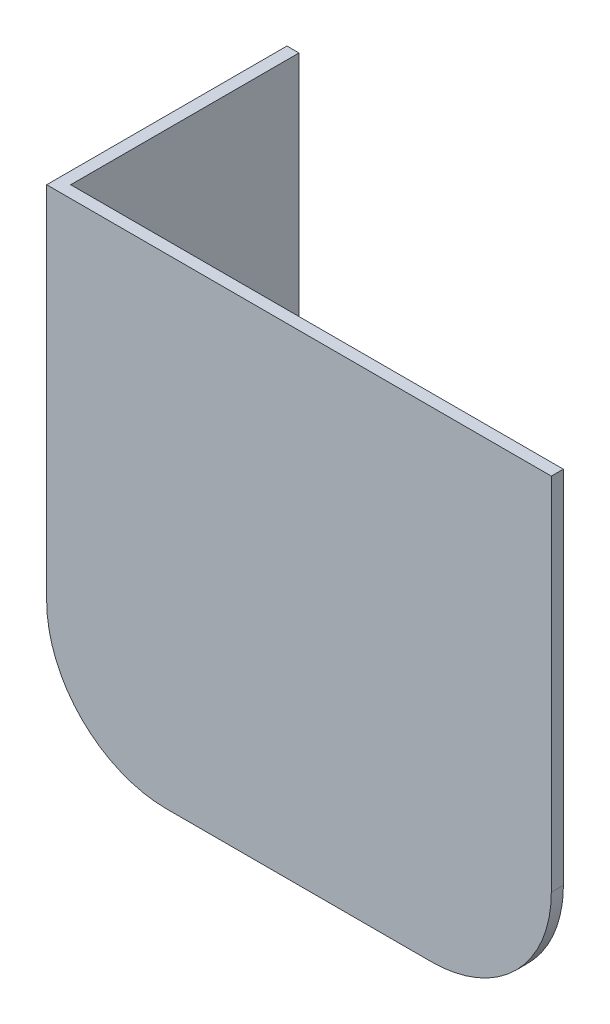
ISO-10303-21;
HEADER;
FILE_DESCRIPTION(('STEP AP214'),'2;1');
FILE_NAME('part.step','',(''),(''),'','','');
FILE_SCHEMA(('AUTOMOTIVE_DESIGN { 1 0 10303 214 1 1 1 1 }'));
ENDSEC;
DATA;
#1=APPLICATION_CONTEXT('core data for automotive mechanical design processes');
#2=APPLICATION_PROTOCOL_DEFINITION('international standard','automotive_design',2000,#1);
#3=PRODUCT_CONTEXT('',#1,'mechanical');
#4=PRODUCT('Part','Part','',(#3));
#5=PRODUCT_RELATED_PRODUCT_CATEGORY('part','',(#4));
#6=PRODUCT_DEFINITION_FORMATION('','',#4);
#7=PRODUCT_DEFINITION_CONTEXT('part definition',#1,'design');
#8=PRODUCT_DEFINITION('design','',#6,#7);
#9=PRODUCT_DEFINITION_SHAPE('','',#8);
#10=(LENGTH_UNIT() NAMED_UNIT(*) SI_UNIT(.MILLI.,.METRE.));
#11=(NAMED_UNIT(*) PLANE_ANGLE_UNIT() SI_UNIT($,.RADIAN.));
#12=(NAMED_UNIT(*) SI_UNIT($,.STERADIAN.) SOLID_ANGLE_UNIT());
#13=UNCERTAINTY_MEASURE_WITH_UNIT(LENGTH_MEASURE(1.E-05),#10,'distance_accuracy_value','');
#14=(GEOMETRIC_REPRESENTATION_CONTEXT(3) GLOBAL_UNCERTAINTY_ASSIGNED_CONTEXT((#13)) GLOBAL_UNIT_ASSIGNED_CONTEXT((#10,
#11,#12)) REPRESENTATION_CONTEXT('',''));
#15=CARTESIAN_POINT('',(0.,0.,0.));
#16=DIRECTION('',(0.,0.,1.));
#17=DIRECTION('',(1.,0.,0.));
#18=AXIS2_PLACEMENT_3D('',#15,#16,#17);
#19=CARTESIAN_POINT('',(0.,-508.,0.));
#20=DIRECTION('',(0.,0.,1.));
#21=DIRECTION('',(1.,0.,0.));
#22=AXIS2_PLACEMENT_3D('',#19,#20,#21);
#23=PLANE('',#22);
#24=DIRECTION('',(1.,0.,0.));
#25=VECTOR('',#24,1.);
#26=CARTESIAN_POINT('',(0.,-508.,0.));
#27=LINE('',#26,#25);
#28=CARTESIAN_POINT('',(127.,-508.,0.));
#29=VERTEX_POINT('',#28);
#30=CARTESIAN_POINT('',(406.4,-508.,0.));
#31=VERTEX_POINT('',#30);
#32=EDGE_CURVE('E144',#29,#31,#27,.T.);
#33=ORIENTED_EDGE('',*,*,#32,.T.);
#34=CARTESIAN_POINT('',(406.4,-381.,0.));
#35=DIRECTION('',(0.,0.,1.));
#36=DIRECTION('',(1.,0.,0.));
#37=AXIS2_PLACEMENT_3D('',#34,#35,#36);
#38=CIRCLE('',#37,127.);
#39=CARTESIAN_POINT('',(533.4,-381.,0.));
#40=VERTEX_POINT('',#39);
#41=EDGE_CURVE('E11',#31,#40,#38,.T.);
#42=ORIENTED_EDGE('',*,*,#41,.T.);
#43=DIRECTION('',(0.,1.,0.));
#44=VECTOR('',#43,1.);
#45=CARTESIAN_POINT('',(533.4,-508.,0.));
#46=LINE('',#45,#44);
#47=CARTESIAN_POINT('',(533.4,0.,0.));
#48=VERTEX_POINT('',#47);
#49=EDGE_CURVE('E142',#40,#48,#46,.T.);
#50=ORIENTED_EDGE('',*,*,#49,.T.);
#51=DIRECTION('',(1.,0.,0.));
#52=VECTOR('',#51,1.);
#53=CARTESIAN_POINT('',(0.,0.,0.));
#54=LINE('',#53,#52);
#55=CARTESIAN_POINT('',(0.,0.,0.));
#56=VERTEX_POINT('',#55);
#57=EDGE_CURVE('E127',#56,#48,#54,.T.);
#58=ORIENTED_EDGE('',*,*,#57,.F.);
#59=DIRECTION('',(0.,1.,0.));
#60=VECTOR('',#59,1.);
#61=CARTESIAN_POINT('',(0.,-508.,0.));
#62=LINE('',#61,#60);
#63=CARTESIAN_POINT('',(0.,-381.,0.));
#64=VERTEX_POINT('',#63);
#65=EDGE_CURVE('E135',#64,#56,#62,.T.);
#66=ORIENTED_EDGE('',*,*,#65,.F.);
#67=CARTESIAN_POINT('',(127.,-381.,0.));
#68=DIRECTION('',(0.,0.,1.));
#69=DIRECTION('',(1.,0.,0.));
#70=AXIS2_PLACEMENT_3D('',#67,#68,#69);
#71=CIRCLE('',#70,127.);
#72=EDGE_CURVE('E150',#64,#29,#71,.T.);
#73=ORIENTED_EDGE('',*,*,#72,.T.);
#74=EDGE_LOOP('',(#33,#42,#50,#58,#66,#73));
#75=FACE_BOUND('',#74,.T.);
#76=ADVANCED_FACE('F30',(#75),#23,.T.);
#77=CARTESIAN_POINT('',(0.,-508.,0.));
#78=DIRECTION('',(-1.,0.,0.));
#79=DIRECTION('',(0.,0.,1.));
#80=AXIS2_PLACEMENT_3D('',#77,#78,#79);
#81=PLANE('',#80);
#82=DIRECTION('',(0.,1.,0.));
#83=VECTOR('',#82,1.);
#84=CARTESIAN_POINT('',(0.,-508.,-254.));
#85=LINE('',#84,#83);
#86=CARTESIAN_POINT('',(0.,-381.,-254.));
#87=VERTEX_POINT('',#86);
#88=CARTESIAN_POINT('',(0.,0.,-254.));
#89=VERTEX_POINT('',#88);
#90=EDGE_CURVE('E133',#87,#89,#85,.T.);
#91=ORIENTED_EDGE('',*,*,#90,.F.);
#92=DIRECTION('',(0.,0.,1.));
#93=VECTOR('',#92,1.);
#94=CARTESIAN_POINT('',(0.,-381.,0.));
#95=LINE('',#94,#93);
#96=EDGE_CURVE('E147',#87,#64,#95,.T.);
#97=ORIENTED_EDGE('',*,*,#96,.T.);
#98=ORIENTED_EDGE('',*,*,#65,.T.);
#99=DIRECTION('',(0.,0.,1.));
#100=VECTOR('',#99,1.);
#101=CARTESIAN_POINT('',(0.,0.,0.));
#102=LINE('',#101,#100);
#103=EDGE_CURVE('E193',#89,#56,#102,.T.);
#104=ORIENTED_EDGE('',*,*,#103,.F.);
#105=EDGE_LOOP('',(#91,#97,#98,#104));
#106=FACE_BOUND('',#105,.T.);
#107=ADVANCED_FACE('F204',(#106),#81,.T.);
#108=CARTESIAN_POINT('',(0.,-508.,-254.));
#109=DIRECTION('',(0.,0.,-1.));
#110=DIRECTION('',(-1.,0.,0.));
#111=AXIS2_PLACEMENT_3D('',#108,#109,#110);
#112=PLANE('',#111);
#113=DIRECTION('',(-1.,0.,0.));
#114=VECTOR('',#113,1.);
#115=CARTESIAN_POINT('',(533.4,-398.78,-254.));
#116=LINE('',#115,#114);
#117=CARTESIAN_POINT('',(12.7,-398.78,-254.));
#118=VERTEX_POINT('',#117);
#119=CARTESIAN_POINT('',(1.25075904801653,-398.78,-254.));
#120=VERTEX_POINT('',#119);
#121=EDGE_CURVE('E106',#118,#120,#116,.T.);
#122=ORIENTED_EDGE('',*,*,#121,.T.);
#123=CARTESIAN_POINT('',(127.,-381.,-254.));
#124=DIRECTION('',(0.,0.,-1.));
#125=DIRECTION('',(-1.,0.,0.));
#126=AXIS2_PLACEMENT_3D('',#123,#124,#125);
#127=CIRCLE('',#126,127.);
#128=EDGE_CURVE('E159',#120,#87,#127,.T.);
#129=ORIENTED_EDGE('',*,*,#128,.T.);
#130=ORIENTED_EDGE('',*,*,#90,.T.);
#131=DIRECTION('',(-1.,0.,0.));
#132=VECTOR('',#131,1.);
#133=CARTESIAN_POINT('',(0.,0.,-254.));
#134=LINE('',#133,#132);
#135=CARTESIAN_POINT('',(12.7,0.,-254.));
#136=VERTEX_POINT('',#135);
#137=EDGE_CURVE('E131',#136,#89,#134,.T.);
#138=ORIENTED_EDGE('',*,*,#137,.F.);
#139=DIRECTION('',(0.,1.,0.));
#140=VECTOR('',#139,1.);
#141=CARTESIAN_POINT('',(12.7,-508.,-254.));
#142=LINE('',#141,#140);
#143=EDGE_CURVE('E124',#118,#136,#142,.T.);
#144=ORIENTED_EDGE('',*,*,#143,.F.);
#145=EDGE_LOOP('',(#122,#129,#130,#138,#144));
#146=FACE_BOUND('',#145,.T.);
#147=ADVANCED_FACE('F129',(#146),#112,.T.);
#148=CARTESIAN_POINT('',(12.7,-508.,-254.));
#149=DIRECTION('',(1.,0.,0.));
#150=DIRECTION('',(0.,0.,-1.));
#151=AXIS2_PLACEMENT_3D('',#148,#149,#150);
#152=PLANE('',#151);
#153=DIRECTION('',(0.,0.,1.));
#154=VECTOR('',#153,1.);
#155=CARTESIAN_POINT('',(12.7,-398.78,-254.));
#156=LINE('',#155,#154);
#157=CARTESIAN_POINT('',(12.7,-398.78,-12.7));
#158=VERTEX_POINT('',#157);
#159=EDGE_CURVE('E110',#118,#158,#156,.T.);
#160=ORIENTED_EDGE('',*,*,#159,.F.);
#161=ORIENTED_EDGE('',*,*,#143,.T.);
#162=DIRECTION('',(0.,0.,-1.));
#163=VECTOR('',#162,1.);
#164=CARTESIAN_POINT('',(12.7,0.,-254.));
#165=LINE('',#164,#163);
#166=CARTESIAN_POINT('',(12.7,0.,-12.7));
#167=VERTEX_POINT('',#166);
#168=EDGE_CURVE('E199',#167,#136,#165,.T.);
#169=ORIENTED_EDGE('',*,*,#168,.F.);
#170=DIRECTION('',(0.,1.,0.));
#171=VECTOR('',#170,1.);
#172=CARTESIAN_POINT('',(12.7,-508.,-12.7));
#173=LINE('',#172,#171);
#174=EDGE_CURVE('E126',#158,#167,#173,.T.);
#175=ORIENTED_EDGE('',*,*,#174,.F.);
#176=EDGE_LOOP('',(#160,#161,#169,#175));
#177=FACE_BOUND('',#176,.T.);
#178=ADVANCED_FACE('F122',(#177),#152,.T.);
#179=CARTESIAN_POINT('',(12.7,-508.,-12.7));
#180=DIRECTION('',(0.,0.,-1.));
#181=DIRECTION('',(-1.,0.,0.));
#182=AXIS2_PLACEMENT_3D('',#179,#180,#181);
#183=PLANE('',#182);
#184=DIRECTION('',(0.,1.,0.));
#185=VECTOR('',#184,1.);
#186=CARTESIAN_POINT('',(533.4,-508.,-12.7));
#187=LINE('',#186,#185);
#188=CARTESIAN_POINT('',(533.4,-381.,-12.7));
#189=VERTEX_POINT('',#188);
#190=CARTESIAN_POINT('',(533.4,0.,-12.7));
#191=VERTEX_POINT('',#190);
#192=EDGE_CURVE('E137',#189,#191,#187,.T.);
#193=ORIENTED_EDGE('',*,*,#192,.F.);
#194=CARTESIAN_POINT('',(406.4,-381.,-12.7));
#195=DIRECTION('',(0.,0.,-1.));
#196=DIRECTION('',(-1.,0.,0.));
#197=AXIS2_PLACEMENT_3D('',#194,#195,#196);
#198=CIRCLE('',#197,127.);
#199=CARTESIAN_POINT('',(532.149240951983,-398.78,-12.7));
#200=VERTEX_POINT('',#199);
#201=EDGE_CURVE('E164',#189,#200,#198,.T.);
#202=ORIENTED_EDGE('',*,*,#201,.T.);
#203=DIRECTION('',(1.,0.,0.));
#204=VECTOR('',#203,1.);
#205=CARTESIAN_POINT('',(12.7,-398.78,-12.7));
#206=LINE('',#205,#204);
#207=EDGE_CURVE('E117',#158,#200,#206,.T.);
#208=ORIENTED_EDGE('',*,*,#207,.F.);
#209=ORIENTED_EDGE('',*,*,#174,.T.);
#210=DIRECTION('',(-1.,0.,0.));
#211=VECTOR('',#210,1.);
#212=CARTESIAN_POINT('',(12.7,0.,-12.7));
#213=LINE('',#212,#211);
#214=EDGE_CURVE('E188',#191,#167,#213,.T.);
#215=ORIENTED_EDGE('',*,*,#214,.F.);
#216=EDGE_LOOP('',(#193,#202,#208,#209,#215));
#217=FACE_BOUND('',#216,.T.);
#218=ADVANCED_FACE('F211',(#217),#183,.T.);
#219=CARTESIAN_POINT('',(533.4,-508.,-12.7));
#220=DIRECTION('',(1.,0.,0.));
#221=DIRECTION('',(0.,0.,-1.));
#222=AXIS2_PLACEMENT_3D('',#219,#220,#221);
#223=PLANE('',#222);
#224=ORIENTED_EDGE('',*,*,#49,.F.);
#225=DIRECTION('',(0.,0.,-1.));
#226=VECTOR('',#225,1.);
#227=CARTESIAN_POINT('',(533.4,-381.,-12.7));
#228=LINE('',#227,#226);
#229=EDGE_CURVE('E161',#40,#189,#228,.T.);
#230=ORIENTED_EDGE('',*,*,#229,.T.);
#231=ORIENTED_EDGE('',*,*,#192,.T.);
#232=DIRECTION('',(0.,0.,-1.));
#233=VECTOR('',#232,1.);
#234=CARTESIAN_POINT('',(533.4,0.,-12.7));
#235=LINE('',#234,#233);
#236=EDGE_CURVE('E183',#48,#191,#235,.T.);
#237=ORIENTED_EDGE('',*,*,#236,.F.);
#238=EDGE_LOOP('',(#224,#230,#231,#237));
#239=FACE_BOUND('',#238,.T.);
#240=ADVANCED_FACE('F180',(#239),#223,.T.);
#241=CARTESIAN_POINT('',(533.4,-508.,0.));
#242=DIRECTION('',(0.,-1.,0.));
#243=DIRECTION('',(0.,0.,-1.));
#244=AXIS2_PLACEMENT_3D('',#241,#242,#243);
#245=PLANE('',#244);
#246=DIRECTION('',(-1.,0.,0.));
#247=VECTOR('',#246,1.);
#248=CARTESIAN_POINT('',(533.4,-508.,-12.6959141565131));
#249=LINE('',#248,#247);
#250=CARTESIAN_POINT('',(406.4,-508.,-12.6959141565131));
#251=VERTEX_POINT('',#250);
#252=CARTESIAN_POINT('',(127.,-508.,-12.6959141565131));
#253=VERTEX_POINT('',#252);
#254=EDGE_CURVE('E145',#251,#253,#249,.T.);
#255=ORIENTED_EDGE('',*,*,#254,.F.);
#256=DIRECTION('',(0.,0.,-1.));
#257=VECTOR('',#256,1.);
#258=CARTESIAN_POINT('',(406.4,-508.,0.));
#259=LINE('',#258,#257);
#260=EDGE_CURVE('E38',#251,#31,#259,.F.);
#261=ORIENTED_EDGE('',*,*,#260,.T.);
#262=ORIENTED_EDGE('',*,*,#32,.F.);
#263=DIRECTION('',(0.,0.,1.));
#264=VECTOR('',#263,1.);
#265=CARTESIAN_POINT('',(127.,-508.,0.));
#266=LINE('',#265,#264);
#267=EDGE_CURVE('E152',#29,#253,#266,.F.);
#268=ORIENTED_EDGE('',*,*,#267,.T.);
#269=EDGE_LOOP('',(#255,#261,#262,#268));
#270=FACE_BOUND('',#269,.T.);
#271=ADVANCED_FACE('F208',(#270),#245,.T.);
#272=CARTESIAN_POINT('',(533.4,0.,0.));
#273=DIRECTION('',(0.,-1.,0.));
#274=DIRECTION('',(0.,0.,-1.));
#275=AXIS2_PLACEMENT_3D('',#272,#273,#274);
#276=PLANE('',#275);
#277=ORIENTED_EDGE('',*,*,#57,.T.);
#278=ORIENTED_EDGE('',*,*,#236,.T.);
#279=ORIENTED_EDGE('',*,*,#214,.T.);
#280=ORIENTED_EDGE('',*,*,#168,.T.);
#281=ORIENTED_EDGE('',*,*,#137,.T.);
#282=ORIENTED_EDGE('',*,*,#103,.T.);
#283=EDGE_LOOP('',(#277,#278,#279,#280,#281,#282));
#284=FACE_BOUND('',#283,.T.);
#285=ADVANCED_FACE('F191',(#284),#276,.F.);
#286=CARTESIAN_POINT('',(533.4,-525.78,-12.6959141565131));
#287=DIRECTION('',(0.,0.,1.));
#288=DIRECTION('',(1.,0.,0.));
#289=AXIS2_PLACEMENT_3D('',#286,#287,#288);
#290=PLANE('',#289);
#291=DIRECTION('',(-1.,0.,0.));
#292=VECTOR('',#291,1.);
#293=CARTESIAN_POINT('',(533.4,-398.78,-12.6959141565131));
#294=LINE('',#293,#292);
#295=CARTESIAN_POINT('',(532.149240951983,-398.78,-12.6959141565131));
#296=VERTEX_POINT('',#295);
#297=CARTESIAN_POINT('',(1.25075904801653,-398.78,-12.6959141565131));
#298=VERTEX_POINT('',#297);
#299=EDGE_CURVE('E118',#296,#298,#294,.T.);
#300=ORIENTED_EDGE('',*,*,#299,.F.);
#301=CARTESIAN_POINT('',(406.4,-381.,-12.6959141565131));
#302=DIRECTION('',(0.,0.,1.));
#303=DIRECTION('',(1.,0.,0.));
#304=AXIS2_PLACEMENT_3D('',#301,#302,#303);
#305=CIRCLE('',#304,127.);
#306=EDGE_CURVE('E52',#296,#251,#305,.F.);
#307=ORIENTED_EDGE('',*,*,#306,.T.);
#308=ORIENTED_EDGE('',*,*,#254,.T.);
#309=CARTESIAN_POINT('',(127.,-381.,-12.6959141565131));
#310=DIRECTION('',(0.,0.,1.));
#311=DIRECTION('',(1.,0.,0.));
#312=AXIS2_PLACEMENT_3D('',#309,#310,#311);
#313=CIRCLE('',#312,127.);
#314=EDGE_CURVE('E155',#253,#298,#313,.F.);
#315=ORIENTED_EDGE('',*,*,#314,.T.);
#316=EDGE_LOOP('',(#300,#307,#308,#315));
#317=FACE_BOUND('',#316,.T.);
#318=ADVANCED_FACE('F170',(#317),#290,.F.);
#319=CARTESIAN_POINT('',(533.4,-398.78,-12.6959141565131));
#320=DIRECTION('',(0.,1.,0.));
#321=DIRECTION('',(0.,0.,1.));
#322=AXIS2_PLACEMENT_3D('',#319,#320,#321);
#323=PLANE('',#322);
#324=ORIENTED_EDGE('',*,*,#207,.T.);
#325=DIRECTION('',(0.,0.,-1.));
#326=VECTOR('',#325,1.);
#327=CARTESIAN_POINT('',(532.149240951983,-398.78,-12.7));
#328=LINE('',#327,#326);
#329=EDGE_CURVE('E166',#200,#296,#328,.F.);
#330=ORIENTED_EDGE('',*,*,#329,.T.);
#331=ORIENTED_EDGE('',*,*,#299,.T.);
#332=DIRECTION('',(0.,0.,1.));
#333=VECTOR('',#332,1.);
#334=CARTESIAN_POINT('',(1.2507590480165,-398.78,-12.6959141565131));
#335=LINE('',#334,#333);
#336=EDGE_CURVE('E113',#298,#120,#335,.F.);
#337=ORIENTED_EDGE('',*,*,#336,.T.);
#338=ORIENTED_EDGE('',*,*,#121,.F.);
#339=ORIENTED_EDGE('',*,*,#159,.T.);
#340=EDGE_LOOP('',(#324,#330,#331,#337,#338,#339));
#341=FACE_BOUND('',#340,.T.);
#342=ADVANCED_FACE('F109',(#341),#323,.F.);
#343=CARTESIAN_POINT('',(127.,-381.,0.));
#344=DIRECTION('',(0.,0.,1.));
#345=DIRECTION('',(1.,0.,0.));
#346=AXIS2_PLACEMENT_3D('',#343,#344,#345);
#347=CYLINDRICAL_SURFACE('',#346,127.);
#348=ORIENTED_EDGE('',*,*,#314,.F.);
#349=ORIENTED_EDGE('',*,*,#267,.F.);
#350=ORIENTED_EDGE('',*,*,#72,.F.);
#351=ORIENTED_EDGE('',*,*,#96,.F.);
#352=ORIENTED_EDGE('',*,*,#128,.F.);
#353=ORIENTED_EDGE('',*,*,#336,.F.);
#354=EDGE_LOOP('',(#348,#349,#350,#351,#352,#353));
#355=FACE_BOUND('',#354,.T.);
#356=ADVANCED_FACE('F209',(#355),#347,.T.);
#357=CARTESIAN_POINT('',(406.4,-381.,-12.7));
#358=DIRECTION('',(0.,0.,-1.));
#359=DIRECTION('',(-1.,0.,0.));
#360=AXIS2_PLACEMENT_3D('',#357,#358,#359);
#361=CYLINDRICAL_SURFACE('',#360,127.);
#362=ORIENTED_EDGE('',*,*,#41,.F.);
#363=ORIENTED_EDGE('',*,*,#260,.F.);
#364=ORIENTED_EDGE('',*,*,#306,.F.);
#365=ORIENTED_EDGE('',*,*,#329,.F.);
#366=ORIENTED_EDGE('',*,*,#201,.F.);
#367=ORIENTED_EDGE('',*,*,#229,.F.);
#368=EDGE_LOOP('',(#362,#363,#364,#365,#366,#367));
#369=FACE_BOUND('',#368,.T.);
#370=ADVANCED_FACE('F32',(#369),#361,.T.);
#371=CLOSED_SHELL('',(#76,#107,#147,#178,#218,#240,#271,#285,#318,#342,#356,#370));
#372=MANIFOLD_SOLID_BREP('B2',#371);
#373=ADVANCED_BREP_SHAPE_REPRESENTATION('',(#18,#372),#14);
#374=SHAPE_DEFINITION_REPRESENTATION(#9,#373);
ENDSEC;
END-ISO-10303-21;
